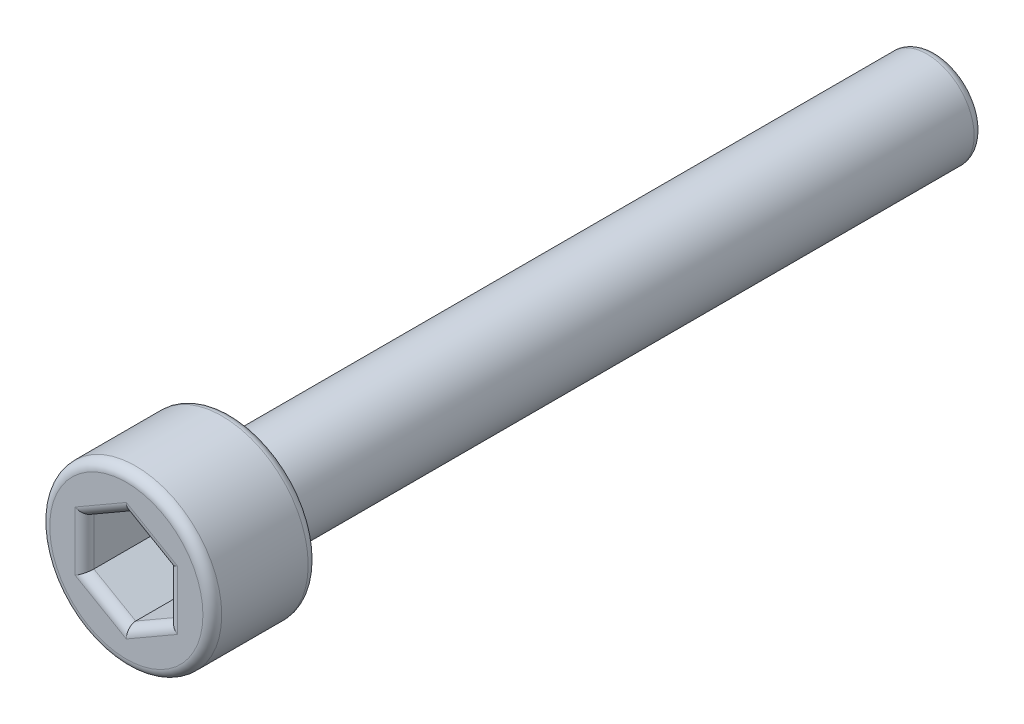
from build123d import *

# Parameters (mm, degrees)
SKETCH1_R          = 1.27
EXTRUDE1_DEPTH     = 19.05
SKETCH2_R          = 2.3241
EXTRUDE2_DEPTH     = 2.8448
CUT_EXTRUDE1_DEPTH = 2.032
FILLET1_R          = 0.254
FILLET2_R          = 0.254
FILLET3_R          = 0.254


with BuildPart() as part:
    # Sketch1 → Extrude1 (new body)
    with BuildSketch(Plane.XY):
        with Locations(Location((0, 0, 0), (0, 0, 180))):
            Circle(SKETCH1_R)
    extrude(amount=EXTRUDE1_DEPTH)

    # Sketch2 → Extrude2 (add)
    with BuildSketch(Plane.XY.offset(19.05)):
        Circle(SKETCH2_R)
    extrude(amount=EXTRUDE2_DEPTH)

    # Sketch3 → Cut-Extrude1 (cut)
    with BuildSketch(Plane.XY.offset(21.8948)):
        Polygon((0, -1.304824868), (1.130011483, -0.652412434), (1.130011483, 0.652412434), (0, 1.304824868), (-1.130011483, 0.652412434), (-1.130011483, -0.652412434), align=None)
    extrude(amount=-CUT_EXTRUDE1_DEPTH, mode=Mode.SUBTRACT)

    # Fillet1
    fillet1_edges = [part.edges().sort_by_distance(p)[0] for p in [
        (-0.565005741, -0.978618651, 21.8948),
        (0.565005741, -0.978618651, 21.8948),
        (1.130011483, 0, 21.8948),
        (0.565005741, 0.978618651, 21.8948),
        (-0.565005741, 0.978618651, 21.8948),
        (-1.130011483, 0, 21.8948),
    ]]
    fillet(fillet1_edges, radius=FILLET1_R)

    # Fillet2
    fillet2_edges = [part.edges().sort_by_distance(p)[0] for p in [
        (-2.3241, 0, 19.05),
        (-2.3241, 0, 21.8948),
    ]]
    fillet(fillet2_edges, radius=FILLET2_R)

    # Fillet3
    fillet3_edges = [part.edges().sort_by_distance(p)[0] for p in [
        (1.27, 0, 0),
    ]]
    fillet(fillet3_edges, radius=FILLET3_R)


solid = part.part
